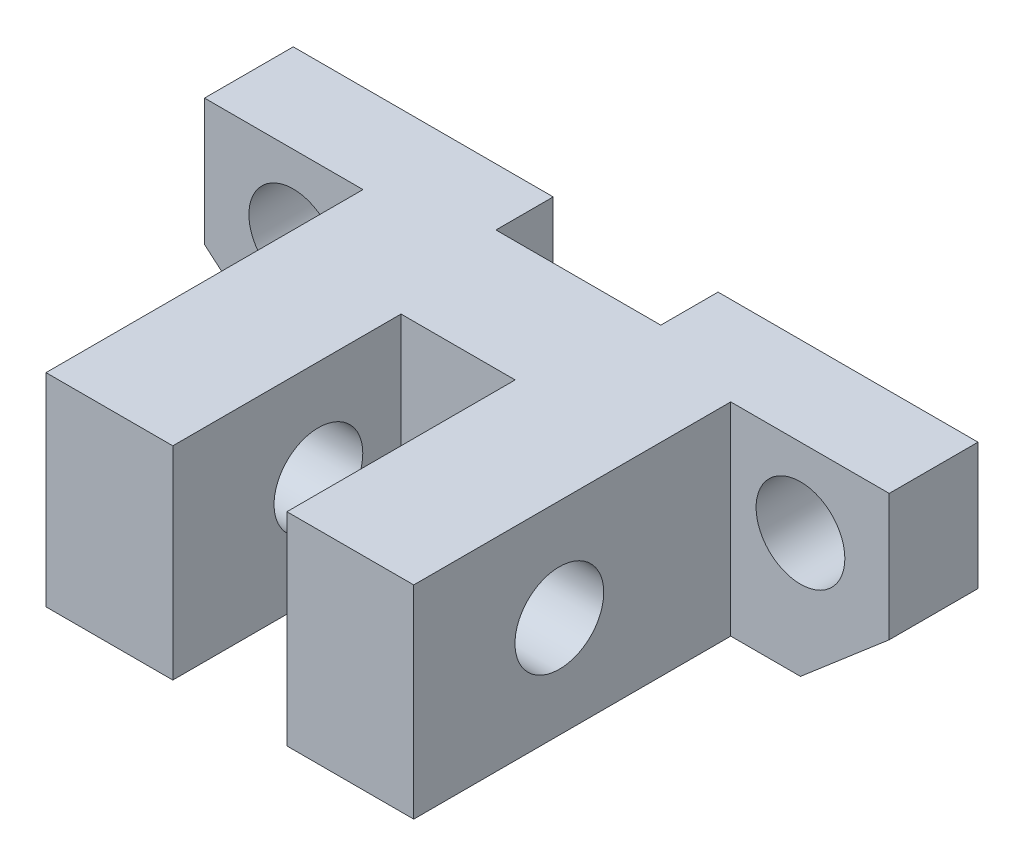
from build123d import *

# Parameters (mm, degrees)
CROQUIS1_R              = 3.5
SALIENTE_EXTRUIR1_DEPTH = 7
CROQUIS2_W              = 29
CROQUIS2_H              = 16
SALIENTE_EXTRUIR2_DEPTH = 25
CROQUIS3_W              = 9
CROQUIS3_H              = 36
CORTAR_EXTRUIR1_DEPTH   = 25
CROQUIS4_W              = 13
CROQUIS4_H              = 9.033078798
CORTAR_EXTRUIR2_DEPTH   = 25
CROQUIS5_R              = 3.5
CORTAR_EXTRUIR3_DEPTH   = 54.011791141


with BuildPart() as part:
    # Croquis1 → Saliente-Extruir1 (new body)
    with BuildSketch(Plane.XY):
        Polygon((-27, -2), (-20, -8), (20, -8), (27, -2), (27, 8), (-27, 8), align=None)
        with Locations((-20, 1.797503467)):
            Circle(CROQUIS1_R, mode=Mode.SUBTRACT)
        with Locations((20, 1.797503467)):
            Circle(CROQUIS1_R, mode=Mode.SUBTRACT)
    extrude(amount=SALIENTE_EXTRUIR1_DEPTH)

    # Croquis2 → Saliente-Extruir2 (add)
    with BuildSketch(Plane.XY.offset(7)):
        Rectangle(CROQUIS2_W, CROQUIS2_H)
    extrude(amount=SALIENTE_EXTRUIR2_DEPTH)

    # Croquis3 → Cortar-Extruir1 (cut)
    with BuildSketch(Plane.XZ.offset(8)):
        with Locations((0, 32)):
            Rectangle(CROQUIS3_W, CROQUIS3_H)
    extrude(amount=-CORTAR_EXTRUIR1_DEPTH, mode=Mode.SUBTRACT)

    # Croquis4 → Cortar-Extruir2 (cut)
    with BuildSketch(Plane.XZ.offset(8)):
        Rectangle(CROQUIS4_W, CROQUIS4_H)
    extrude(amount=-CORTAR_EXTRUIR2_DEPTH, mode=Mode.SUBTRACT)

    # Croquis5 → Cortar-Extruir3 (cut, through all)
    with BuildSketch(Plane(origin=(14.5, 0, 0), x_dir=(0, 0, -1), z_dir=(1, 0, 0))):
        with Locations((-20.516539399, 0)):
            Circle(CROQUIS5_R)
    extrude(amount=-CORTAR_EXTRUIR3_DEPTH, mode=Mode.SUBTRACT)


solid = part.part
